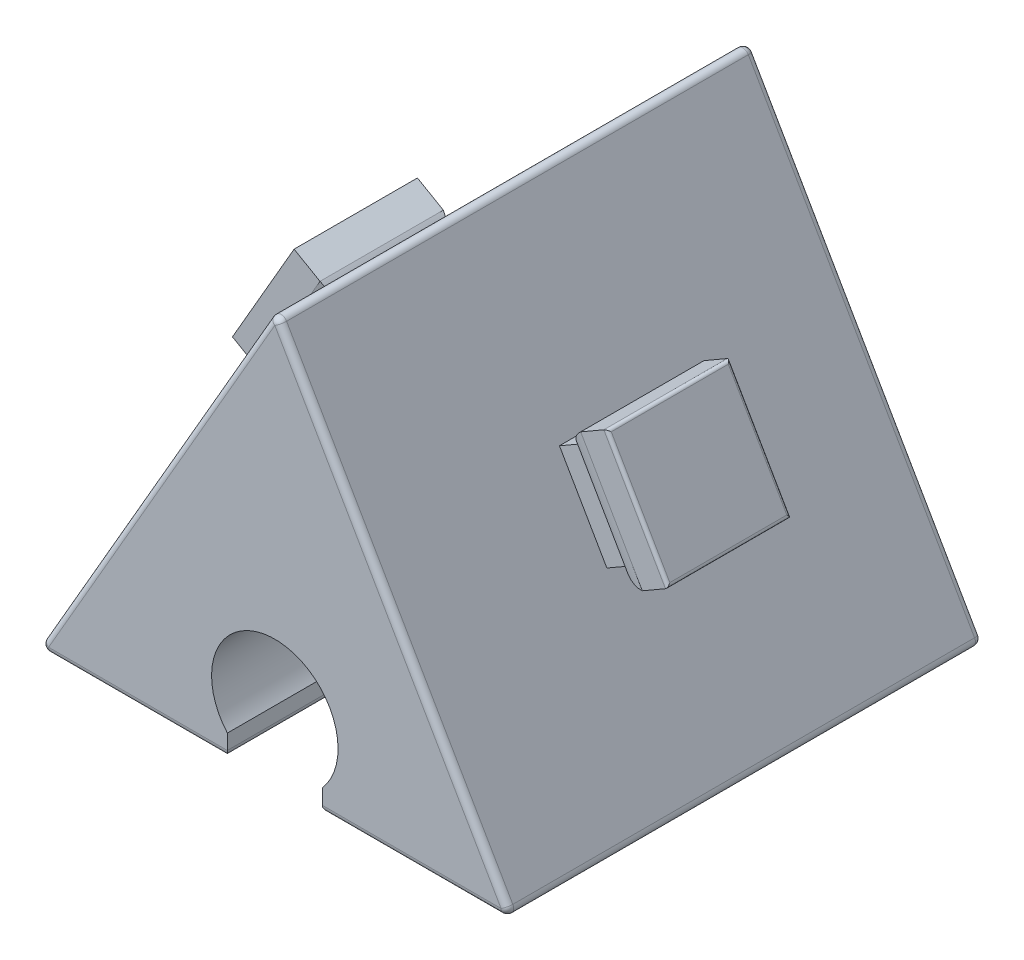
from build123d import *

# Parameters (mm, degrees)
EXTRUDE_1_DEPTH        = 7.5
EXTRUDE_1_DEPTH_BACK   = 7.5
CUT_EXTRUDE_1_REACH    = 23.213
EXTRUDE_2_DEPTH        = 2
EXTRUDE_2_DEPTH_BACK   = 2
EXTRUDE_2_2_DEPTH      = 2
EXTRUDE_2_2_DEPTH_BACK = 2
EXTRUDE_4_DEPTH        = 1.5
CUT_EXTRUDE_2_DEPTH    = 17.046494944
FILLET_1_R             = 0.1
FILLET_2_R             = 0.2
CUT_EXTRUDE_3_REACH    = 17.828


with BuildPart() as part:
    # Sketch 1 → Extrude 1 (new, two sides: drawn at the far end of the back side and taken through both)
    with BuildSketch(Plane.XY.offset(-EXTRUDE_1_DEPTH_BACK)):
        Polygon((-7.5, 0), (0, 12.990381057), (7.5, 0), align=None)
    extrude(amount=EXTRUDE_1_DEPTH + EXTRUDE_1_DEPTH_BACK)

    # Sketch 2 → Cut-Extrude 1 (cut, up to next)
    with BuildSketch(Plane.XY.offset(7.5), mode=Mode.PRIVATE) as cut_extrude_1_sk1:
        with BuildLine():
            Line((-1.5, 0.677124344), (-1.5, 0))
            Line((-1.5, 0), (1.5, 0))
            Line((1.5, 0), (1.5, 0.677124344))
            ThreePointArc((1.5, 0.677124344), (0, 4), (-1.5, 0.677124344))
        make_face()
    cut_extrude_1_tool1 = extrude(cut_extrude_1_sk1.sketch, amount=-CUT_EXTRUDE_1_REACH, mode=Mode.PRIVATE) & part.part
    add(cut_extrude_1_tool1.solids().sort_by_distance((0, 1.914707, 7.5))[0], mode=Mode.SUBTRACT)



with BuildPart() as body_2:
    # Sketch 3 → Extrude 2 (new, two sides: drawn at the far end of the back side and taken through both)
    with BuildSketch(Plane.XY.offset(-EXTRUDE_2_DEPTH_BACK)):
        with BuildLine():
            Line((3.586406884, 8.132790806), (5.086406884, 5.534714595))
            ThreePointArc((5.086406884, 5.534714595), (5.582396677, 5.497709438), (6.0721807, 5.584236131))
            Line((6.0721807, 5.584236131), (6.890063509, 6.056440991))
            Line((6.890063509, 6.056440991), (5.915063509, 7.745190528))
            Line((5.915063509, 7.745190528), (4.940063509, 9.433940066))
            Line((4.940063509, 9.433940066), (4.1221807, 8.961735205))
            ThreePointArc((4.1221807, 8.961735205), (3.802354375, 8.580833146), (3.586406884, 8.132790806))
        make_face()
    extrude(amount=EXTRUDE_2_DEPTH + EXTRUDE_2_DEPTH_BACK)


with BuildPart() as body_3:
    # Sketch 3 → Extrude 2 2 (new, two sides: drawn at the far end of the back side and taken through both)
    with BuildSketch(Plane.XY.offset(-EXTRUDE_2_2_DEPTH_BACK)):
        with BuildLine():
            Line((-4.940063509, 9.433940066), (-4.1221807, 8.961735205))
            ThreePointArc((-4.1221807, 8.961735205), (-3.802354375, 8.580833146), (-3.586406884, 8.132790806))
            Line((-3.586406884, 8.132790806), (-5.086406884, 5.534714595))
            ThreePointArc((-5.086406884, 5.534714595), (-5.582396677, 5.497709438), (-6.0721807, 5.584236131))
            Line((-6.0721807, 5.584236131), (-6.890063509, 6.056440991))
            Line((-6.890063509, 6.056440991), (-5.915063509, 7.745190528))
            Line((-5.915063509, 7.745190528), (-4.940063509, 9.433940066))
        make_face()
    extrude(amount=EXTRUDE_2_2_DEPTH + EXTRUDE_2_2_DEPTH_BACK)

    # Cut-Extrude 3: up to this face of the body (flat: up to its plane)
    cut_extrude_3_end = Plane(body_3.part.faces().sort_by_distance((-4.531122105, 9.197837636, 0))[0])
    # Sketch 7 → Cut-Extrude 3 (cut, up to the picked face)
    with BuildSketch(Plane(origin=(0.9, 1.558845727, 0), x_dir=(0.8660254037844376, -0.5000000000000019, 0), z_dir=(-0.5000000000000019, -0.8660254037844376, 0)), mode=Mode.PRIVATE) as cut_extrude_3_sk1:
        with BuildLine():
            Line((-8.995190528, 2), (-7.172314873, 2))
            Line((-7.172314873, 2), (-7.172314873, 1.5))
            ThreePointArc((-7.172314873, 1.5), (-7.583352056, 1.780042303), (-8.050780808, 1.95))
            Line((-8.050780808, 1.95), (-8.995190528, 1.95))
            Line((-8.995190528, 1.95), (-8.995190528, 2))
        make_face()
    cut_extrude_3_tool1 = split(extrude(cut_extrude_3_sk1.sketch, amount=-CUT_EXTRUDE_3_REACH, mode=Mode.PRIVATE), bisect_by=cut_extrude_3_end, keep=Keep.BOTH, mode=Mode.PRIVATE)
    # Sketch 7 → Cut-Extrude 3 (cut, up to the picked face)
    with BuildSketch(Plane(origin=(0.9, 1.558845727, 0), x_dir=(0.8660254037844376, -0.5000000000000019, 0), z_dir=(-0.5000000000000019, -0.8660254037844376, 0)), mode=Mode.PRIVATE) as cut_extrude_3_sk2:
        with BuildLine():
            Line((-8.995190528, -2), (-7.172314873, -2))
            Line((-7.172314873, -2), (-7.172314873, -1.5))
            ThreePointArc((-7.172314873, -1.5), (-7.583352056, -1.780042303), (-8.050780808, -1.95))
            Line((-8.050780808, -1.95), (-8.995190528, -1.95))
            Line((-8.995190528, -1.95), (-8.995190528, -2))
        make_face()
    cut_extrude_3_tool2 = split(extrude(cut_extrude_3_sk2.sketch, amount=-CUT_EXTRUDE_3_REACH, mode=Mode.PRIVATE), bisect_by=cut_extrude_3_end, keep=Keep.BOTH, mode=Mode.PRIVATE)
    add(cut_extrude_3_tool1.solids().sort_by(Axis((-5.742645, 5.393979, 1.873038), (0.5000000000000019, 0.8660254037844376, 0)))[0], mode=Mode.SUBTRACT)
    add(cut_extrude_3_tool2.solids().sort_by(Axis((-5.742645, 5.393979, -1.873038), (0.5000000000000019, 0.8660254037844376, 0)))[0], mode=Mode.SUBTRACT)


with BuildPart() as part_1:
    add(part.part)

    add(body_2.part)  # Extrude 4 merges body 2
    # Sketch 5 → Extrude 4 (add, symmetric)
    with BuildSketch(Plane.XY):
        Polygon((3.586406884, 8.132790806), (5.086406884, 5.534714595), (4.5, 5.196152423), (3, 7.794228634), align=None)
    extrude_4 = extrude(amount=EXTRUDE_4_DEPTH, both=True)

    # Sketch 6 → Cut-Extrude 2 (cut, through all)
    with BuildSketch(Plane(origin=(-0.9, 1.558845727, 0), x_dir=(0.8660254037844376, 0.5000000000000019, 0), z_dir=(0.5000000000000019, -0.8660254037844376, 0))):
        with BuildLine():
            Line((8.995190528, -2), (8.995190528, -1.95))
            Line((8.995190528, -1.95), (8.050780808, -1.95))
            ThreePointArc((8.050780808, -1.95), (7.583352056, -1.780042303), (7.172314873, -1.5))
            Line((7.172314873, -1.5), (7.172314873, -2))
            Line((7.172314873, -2), (8.995190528, -2))
        make_face()
        with BuildLine():
            Line((8.995190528, 1.95), (8.050780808, 1.95))
            ThreePointArc((8.050780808, 1.95), (7.583352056, 1.780042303), (7.172314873, 1.5))
            Line((7.172314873, 1.5), (7.172314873, 2))
            Line((7.172314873, 2), (8.995190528, 2))
            Line((8.995190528, 2), (8.995190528, 1.95))
        make_face()
    extrude(amount=-CUT_EXTRUDE_2_DEPTH, mode=Mode.SUBTRACT)

    # Fillet 1
    fillet_1_edges = [part_1.edges().sort_by_distance(p)[0] for p in [
        (5.915063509, 7.745190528, 1.95),
        (6.890063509, 6.056440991, 0),
        (4.940063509, 9.433940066, 0),
        (5.915063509, 7.745190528, -1.95),
    ]]
    fillet(fillet_1_edges, radius=FILLET_1_R)

    # Fillet 2
    fillet_2_edges = [part_1.edges().sort_by_distance(p)[0] for p in [
        (-3.75, 6.495190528, -7.5),
        (3.75, 6.495190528, 7.5),
        (-3.75, 6.495190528, 7.5),
        (4.5, 0, 7.5),
        (4.5, 0, -7.5),
        (1.5, 0, 0),
        (-1.5, 0, 0),
        (-4.5, 0, -7.5),
        (-7.5, 0, 0),
        (0, 12.990381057, 0),
        (7.5, 0, 0),
        (3.75, 6.495190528, -7.5),
        (-4.5, 0, 7.5),
    ]]
    fillet(fillet_2_edges, radius=FILLET_2_R)

    # Mirror 9: Extrude 4 across plane
    add(extrude_4.mirror(Plane(origin=(0, 0, 0), x_dir=(0, 0, 1), z_dir=(1, 0, 0))))


solid = Compound([body_3.part, part_1.part])
